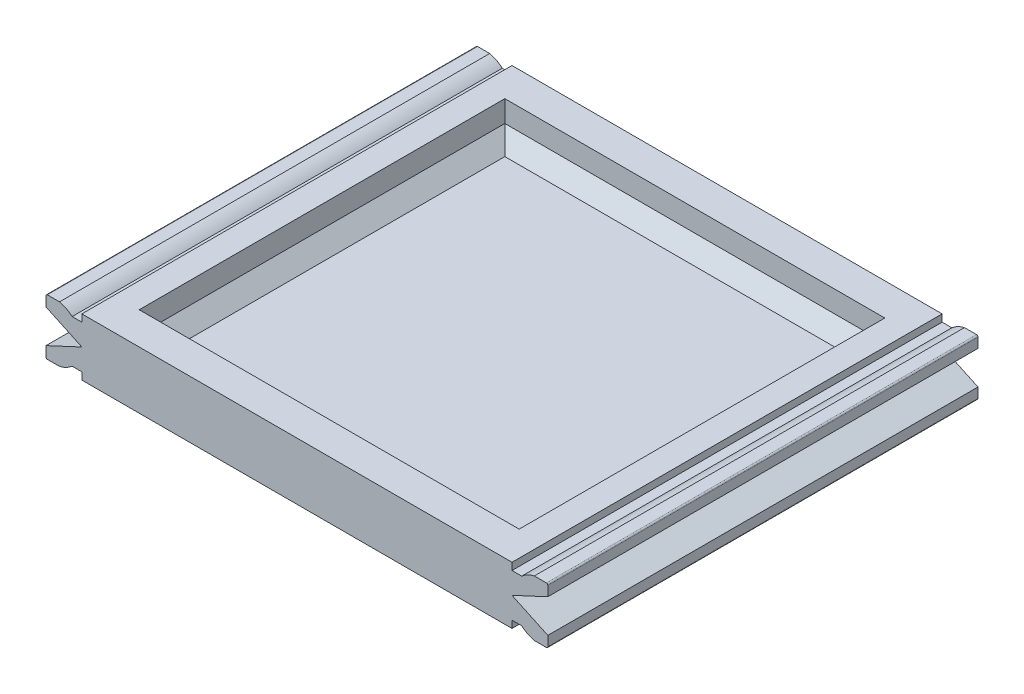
from build123d import *

# Parameters (mm, degrees)
EXTRUDE_1_DEPTH       = 2
EXTRUDE_1_DEPTH_BACK  = 2
SKETCH_1_W            = 30
SKETCH_1_H            = 30
SKETCH_2_W            = 26.5
SKETCH_2_H            = 25.5
CUT_EXTRUDE_1_DEPTH   = 2.5
CHAMFER_1_SIZE        = 1
EXTRUDE_2_DEPTH       = 15
MIRROR_2_COPY_1_DEPTH = 15
FILLET_1_R            = 0.1


with BuildPart() as part:
    # Sketch 1 → Extrude 1 (new, two sides: drawn at the far end of the back side and taken through both)
    with BuildSketch(Plane(origin=(0, 0, 0), x_dir=(1, 0, 0), z_dir=(0, 1, 0)).offset(-EXTRUDE_1_DEPTH_BACK)):
        Rectangle(SKETCH_1_W, SKETCH_1_H)
    extrude(amount=EXTRUDE_1_DEPTH + EXTRUDE_1_DEPTH_BACK)

    # Sketch 2 → Cut-Extrude 1 (cut)
    with BuildSketch(Plane(origin=(0, 2, 0), x_dir=(1, 0, 0), z_dir=(0, 1, 0))):
        Rectangle(SKETCH_2_W, SKETCH_2_H)
    extrude(amount=-CUT_EXTRUDE_1_DEPTH, mode=Mode.SUBTRACT)

    # Chamfer 1
    chamfer_1_edges = [part.edges().sort_by_distance(p)[0] for p in [
        (0, -0.5, -12.75),
        (13.25, -0.5, 0),
        (0, -0.5, 12.75),
        (-13.25, -0.5, 0),
    ]]
    chamfer(chamfer_1_edges, length=CHAMFER_1_SIZE)

    # Sketch 3 → Extrude 2 (add, symmetric)
    with BuildSketch(Plane.XY):
        with BuildLine():
            Line((15.677124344, 1.5), (15, 1.5))
            Line((15, 1.5), (15, 0))
            Line((15, 0), (17.5, 1.165769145))
            Line((17.5, 1.165769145), (17.5, 1.95))
            Line((17.5, 1.95), (16.555590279, 1.95))
            ThreePointArc((16.555590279, 1.95), (16.088161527, 1.780042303), (15.677124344, 1.5))
        make_face()
    extrude_2 = extrude(amount=EXTRUDE_2_DEPTH, both=True)

    # Mirror 1: Extrude 2 across plane
    add(extrude_2.mirror(Plane.ZX))

    # Mirror 2: Extrude 2 across plane
    add(extrude_2.mirror(Plane(origin=(0, 0, 0), x_dir=(0, 0, 1), z_dir=(1, 0, 0))))

    # Mirror 2 copy 1 sketch → Mirror 2 copy 1 (add, symmetric)
    with BuildSketch(Plane(origin=(0, 0, 0), x_dir=(-1, 0, 0), z_dir=(0, 0, 1))):
        with BuildLine():
            Line((15.677124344, 1.5), (15, 1.5))
            Line((15, 1.5), (15, 0))
            Line((15, 0), (17.5, 1.165769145))
            Line((17.5, 1.165769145), (17.5, 1.95))
            Line((17.5, 1.95), (16.555590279, 1.95))
            ThreePointArc((16.555590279, 1.95), (16.088161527, 1.780042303), (15.677124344, 1.5))
        make_face()
    extrude(amount=MIRROR_2_COPY_1_DEPTH, both=True)

    # Fillet 1
    fillet_1_edges = [part.edges().sort_by_distance(p)[0] for p in [
        (-17.5, -1.95, 0),
        (17.5, 1.95, 0),
        (17.5, -1.95, 0),
        (-17.5, 1.95, 0),
    ]]
    fillet(fillet_1_edges, radius=FILLET_1_R)


solid = part.part
